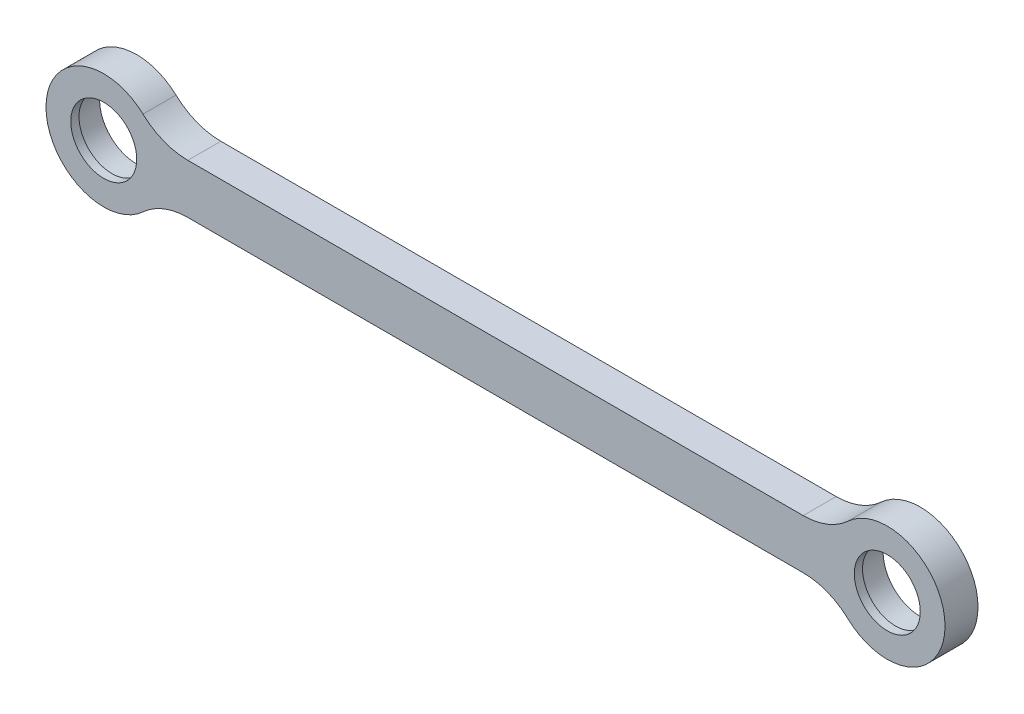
ISO-10303-21;
HEADER;
FILE_DESCRIPTION(('STEP AP214'),'2;1');
FILE_NAME('part.step','',(''),(''),'','','');
FILE_SCHEMA(('AUTOMOTIVE_DESIGN { 1 0 10303 214 1 1 1 1 }'));
ENDSEC;
DATA;
#1=APPLICATION_CONTEXT('core data for automotive mechanical design processes');
#2=APPLICATION_PROTOCOL_DEFINITION('international standard','automotive_design',2000,#1);
#3=PRODUCT_CONTEXT('',#1,'mechanical');
#4=PRODUCT('Part','Part','',(#3));
#5=PRODUCT_RELATED_PRODUCT_CATEGORY('part','',(#4));
#6=PRODUCT_DEFINITION_FORMATION('','',#4);
#7=PRODUCT_DEFINITION_CONTEXT('part definition',#1,'design');
#8=PRODUCT_DEFINITION('design','',#6,#7);
#9=PRODUCT_DEFINITION_SHAPE('','',#8);
#10=(LENGTH_UNIT() NAMED_UNIT(*) SI_UNIT(.MILLI.,.METRE.));
#11=(NAMED_UNIT(*) PLANE_ANGLE_UNIT() SI_UNIT($,.RADIAN.));
#12=(NAMED_UNIT(*) SI_UNIT($,.STERADIAN.) SOLID_ANGLE_UNIT());
#13=UNCERTAINTY_MEASURE_WITH_UNIT(LENGTH_MEASURE(1.E-05),#10,'distance_accuracy_value','');
#14=(GEOMETRIC_REPRESENTATION_CONTEXT(3) GLOBAL_UNCERTAINTY_ASSIGNED_CONTEXT((#13)) GLOBAL_UNIT_ASSIGNED_CONTEXT((#10,
#11,#12)) REPRESENTATION_CONTEXT('',''));
#15=CARTESIAN_POINT('',(0.,0.,0.));
#16=DIRECTION('',(0.,0.,1.));
#17=DIRECTION('',(1.,0.,0.));
#18=AXIS2_PLACEMENT_3D('',#15,#16,#17);
#19=CARTESIAN_POINT('',(0.,0.,0.));
#20=DIRECTION('',(0.,0.,1.));
#21=DIRECTION('',(1.,0.,0.));
#22=AXIS2_PLACEMENT_3D('',#19,#20,#21);
#23=CYLINDRICAL_SURFACE('',#22,4.5);
#24=CARTESIAN_POINT('',(0.,0.,0.));
#25=DIRECTION('',(0.,0.,1.));
#26=DIRECTION('',(1.,0.,0.));
#27=AXIS2_PLACEMENT_3D('',#24,#25,#26);
#28=CIRCLE('',#27,4.5);
#29=CARTESIAN_POINT('',(4.5,0.,0.));
#30=VERTEX_POINT('',#29);
#31=EDGE_CURVE('E224',#30,#30,#28,.T.);
#32=ORIENTED_EDGE('',*,*,#31,.F.);
#33=EDGE_LOOP('',(#32));
#34=FACE_BOUND('',#33,.T.);
#35=CARTESIAN_POINT('',(0.,0.,3.));
#36=DIRECTION('',(0.,0.,1.));
#37=DIRECTION('',(1.,0.,0.));
#38=AXIS2_PLACEMENT_3D('',#35,#36,#37);
#39=CIRCLE('',#38,4.5);
#40=CARTESIAN_POINT('',(4.5,0.,3.));
#41=VERTEX_POINT('',#40);
#42=EDGE_CURVE('E11',#41,#41,#39,.F.);
#43=ORIENTED_EDGE('',*,*,#42,.F.);
#44=EDGE_LOOP('',(#43));
#45=FACE_BOUND('',#44,.T.);
#46=ADVANCED_FACE('F34',(#34,#45),#23,.F.);
#47=CARTESIAN_POINT('',(95.,0.,0.));
#48=DIRECTION('',(0.,0.,1.));
#49=DIRECTION('',(1.,0.,0.));
#50=AXIS2_PLACEMENT_3D('',#47,#48,#49);
#51=CYLINDRICAL_SURFACE('',#50,4.5);
#52=CARTESIAN_POINT('',(95.,0.,0.));
#53=DIRECTION('',(0.,0.,1.));
#54=DIRECTION('',(1.,0.,0.));
#55=AXIS2_PLACEMENT_3D('',#52,#53,#54);
#56=CIRCLE('',#55,4.5);
#57=CARTESIAN_POINT('',(99.5,0.,0.));
#58=VERTEX_POINT('',#57);
#59=EDGE_CURVE('E229',#58,#58,#56,.T.);
#60=ORIENTED_EDGE('',*,*,#59,.F.);
#61=EDGE_LOOP('',(#60));
#62=FACE_BOUND('',#61,.T.);
#63=CARTESIAN_POINT('',(95.,0.,3.));
#64=DIRECTION('',(0.,0.,1.));
#65=DIRECTION('',(1.,0.,0.));
#66=AXIS2_PLACEMENT_3D('',#63,#64,#65);
#67=CIRCLE('',#66,4.5);
#68=CARTESIAN_POINT('',(99.5,0.,3.));
#69=VERTEX_POINT('',#68);
#70=EDGE_CURVE('E42',#69,#69,#67,.F.);
#71=ORIENTED_EDGE('',*,*,#70,.F.);
#72=EDGE_LOOP('',(#71));
#73=FACE_BOUND('',#72,.T.);
#74=ADVANCED_FACE('F163',(#62,#73),#51,.F.);
#75=CARTESIAN_POINT('',(0.,0.,4.));
#76=DIRECTION('',(0.,0.,1.));
#77=DIRECTION('',(1.,0.,0.));
#78=AXIS2_PLACEMENT_3D('',#75,#76,#77);
#79=PLANE('',#78);
#80=DIRECTION('',(-1.,0.,0.));
#81=VECTOR('',#80,1.);
#82=CARTESIAN_POINT('',(6.32455532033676,3.,4.));
#83=LINE('',#82,#81);
#84=CARTESIAN_POINT('',(84.8019609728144,3.,4.));
#85=VERTEX_POINT('',#84);
#86=CARTESIAN_POINT('',(10.1980390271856,3.,4.));
#87=VERTEX_POINT('',#86);
#88=EDGE_CURVE('E119',#85,#87,#83,.T.);
#89=ORIENTED_EDGE('',*,*,#88,.T.);
#90=CARTESIAN_POINT('',(10.1980390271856,11.,4.));
#91=DIRECTION('',(0.,0.,1.));
#92=DIRECTION('',(1.,0.,0.));
#93=AXIS2_PLACEMENT_3D('',#90,#91,#92);
#94=CIRCLE('',#93,8.);
#95=CARTESIAN_POINT('',(4.75908487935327,5.13333333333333,4.));
#96=VERTEX_POINT('',#95);
#97=EDGE_CURVE('E56',#87,#96,#94,.F.);
#98=ORIENTED_EDGE('',*,*,#97,.T.);
#99=CARTESIAN_POINT('',(0.,0.,4.));
#100=DIRECTION('',(0.,0.,1.));
#101=DIRECTION('',(1.,0.,0.));
#102=AXIS2_PLACEMENT_3D('',#99,#100,#101);
#103=CIRCLE('',#102,7.);
#104=CARTESIAN_POINT('',(4.75908487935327,-5.13333333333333,4.));
#105=VERTEX_POINT('',#104);
#106=EDGE_CURVE('E126',#96,#105,#103,.T.);
#107=ORIENTED_EDGE('',*,*,#106,.T.);
#108=CARTESIAN_POINT('',(10.1980390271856,-11.,4.));
#109=DIRECTION('',(0.,0.,1.));
#110=DIRECTION('',(1.,0.,0.));
#111=AXIS2_PLACEMENT_3D('',#108,#109,#110);
#112=CIRCLE('',#111,8.);
#113=CARTESIAN_POINT('',(10.1980390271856,-3.,4.));
#114=VERTEX_POINT('',#113);
#115=EDGE_CURVE('E155',#105,#114,#112,.F.);
#116=ORIENTED_EDGE('',*,*,#115,.T.);
#117=DIRECTION('',(1.,0.,0.));
#118=VECTOR('',#117,1.);
#119=CARTESIAN_POINT('',(6.32455532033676,-3.,4.));
#120=LINE('',#119,#118);
#121=CARTESIAN_POINT('',(84.8019609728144,-3.,4.));
#122=VERTEX_POINT('',#121);
#123=EDGE_CURVE('E129',#114,#122,#120,.T.);
#124=ORIENTED_EDGE('',*,*,#123,.T.);
#125=CARTESIAN_POINT('',(84.8019609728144,-11.,4.));
#126=DIRECTION('',(0.,0.,1.));
#127=DIRECTION('',(1.,0.,0.));
#128=AXIS2_PLACEMENT_3D('',#125,#126,#127);
#129=CIRCLE('',#128,8.);
#130=CARTESIAN_POINT('',(90.2409151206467,-5.13333333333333,4.));
#131=VERTEX_POINT('',#130);
#132=EDGE_CURVE('E151',#122,#131,#129,.F.);
#133=ORIENTED_EDGE('',*,*,#132,.T.);
#134=CARTESIAN_POINT('',(95.,0.,4.));
#135=DIRECTION('',(0.,0.,1.));
#136=DIRECTION('',(1.,0.,0.));
#137=AXIS2_PLACEMENT_3D('',#134,#135,#136);
#138=CIRCLE('',#137,6.99999999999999);
#139=CARTESIAN_POINT('',(90.2409151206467,5.13333333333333,4.));
#140=VERTEX_POINT('',#139);
#141=EDGE_CURVE('E216',#131,#140,#138,.T.);
#142=ORIENTED_EDGE('',*,*,#141,.T.);
#143=CARTESIAN_POINT('',(84.8019609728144,11.,4.));
#144=DIRECTION('',(0.,0.,1.));
#145=DIRECTION('',(1.,0.,0.));
#146=AXIS2_PLACEMENT_3D('',#143,#144,#145);
#147=CIRCLE('',#146,8.);
#148=EDGE_CURVE('E111',#140,#85,#147,.F.);
#149=ORIENTED_EDGE('',*,*,#148,.T.);
#150=EDGE_LOOP('',(#89,#98,#107,#116,#124,#133,#142,#149));
#151=FACE_BOUND('',#150,.T.);
#152=CARTESIAN_POINT('',(95.,0.,4.));
#153=DIRECTION('',(0.,0.,1.));
#154=DIRECTION('',(1.,0.,0.));
#155=AXIS2_PLACEMENT_3D('',#152,#153,#154);
#156=CIRCLE('',#155,4.00000000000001);
#157=CARTESIAN_POINT('',(99.,0.,4.));
#158=VERTEX_POINT('',#157);
#159=EDGE_CURVE('E236',#158,#158,#156,.T.);
#160=ORIENTED_EDGE('',*,*,#159,.F.);
#161=EDGE_LOOP('',(#160));
#162=FACE_BOUND('',#161,.T.);
#163=CARTESIAN_POINT('',(0.,0.,4.));
#164=DIRECTION('',(0.,0.,1.));
#165=DIRECTION('',(1.,0.,0.));
#166=AXIS2_PLACEMENT_3D('',#163,#164,#165);
#167=CIRCLE('',#166,4.);
#168=CARTESIAN_POINT('',(4.,0.,4.));
#169=VERTEX_POINT('',#168);
#170=EDGE_CURVE('E242',#169,#169,#167,.T.);
#171=ORIENTED_EDGE('',*,*,#170,.F.);
#172=EDGE_LOOP('',(#171));
#173=FACE_BOUND('',#172,.T.);
#174=ADVANCED_FACE('F165',(#151,#162,#173),#79,.T.);
#175=CARTESIAN_POINT('',(0.,0.,0.));
#176=DIRECTION('',(0.,0.,1.));
#177=DIRECTION('',(1.,0.,0.));
#178=AXIS2_PLACEMENT_3D('',#175,#176,#177);
#179=PLANE('',#178);
#180=ORIENTED_EDGE('',*,*,#59,.T.);
#181=EDGE_LOOP('',(#180));
#182=FACE_BOUND('',#181,.T.);
#183=ORIENTED_EDGE('',*,*,#31,.T.);
#184=EDGE_LOOP('',(#183));
#185=FACE_BOUND('',#184,.T.);
#186=CARTESIAN_POINT('',(0.,0.,0.));
#187=DIRECTION('',(0.,0.,1.));
#188=DIRECTION('',(1.,0.,0.));
#189=AXIS2_PLACEMENT_3D('',#186,#187,#188);
#190=CIRCLE('',#189,7.);
#191=CARTESIAN_POINT('',(4.75908487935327,5.13333333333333,0.));
#192=VERTEX_POINT('',#191);
#193=CARTESIAN_POINT('',(4.75908487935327,-5.13333333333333,0.));
#194=VERTEX_POINT('',#193);
#195=EDGE_CURVE('E223',#192,#194,#190,.T.);
#196=ORIENTED_EDGE('',*,*,#195,.F.);
#197=CARTESIAN_POINT('',(10.1980390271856,11.,0.));
#198=DIRECTION('',(0.,0.,1.));
#199=DIRECTION('',(1.,0.,0.));
#200=AXIS2_PLACEMENT_3D('',#197,#198,#199);
#201=CIRCLE('',#200,8.);
#202=CARTESIAN_POINT('',(10.1980390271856,3.,0.));
#203=VERTEX_POINT('',#202);
#204=EDGE_CURVE('E125',#192,#203,#201,.T.);
#205=ORIENTED_EDGE('',*,*,#204,.T.);
#206=DIRECTION('',(-1.,0.,0.));
#207=VECTOR('',#206,1.);
#208=CARTESIAN_POINT('',(6.32455532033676,3.,0.));
#209=LINE('',#208,#207);
#210=CARTESIAN_POINT('',(84.8019609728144,3.,0.));
#211=VERTEX_POINT('',#210);
#212=EDGE_CURVE('E117',#211,#203,#209,.T.);
#213=ORIENTED_EDGE('',*,*,#212,.F.);
#214=CARTESIAN_POINT('',(84.8019609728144,11.,0.));
#215=DIRECTION('',(0.,0.,1.));
#216=DIRECTION('',(1.,0.,0.));
#217=AXIS2_PLACEMENT_3D('',#214,#215,#216);
#218=CIRCLE('',#217,8.);
#219=CARTESIAN_POINT('',(90.2409151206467,5.13333333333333,0.));
#220=VERTEX_POINT('',#219);
#221=EDGE_CURVE('E101',#211,#220,#218,.T.);
#222=ORIENTED_EDGE('',*,*,#221,.T.);
#223=CARTESIAN_POINT('',(95.,0.,0.));
#224=DIRECTION('',(0.,0.,1.));
#225=DIRECTION('',(1.,0.,0.));
#226=AXIS2_PLACEMENT_3D('',#223,#224,#225);
#227=CIRCLE('',#226,6.99999999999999);
#228=CARTESIAN_POINT('',(90.2409151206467,-5.13333333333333,0.));
#229=VERTEX_POINT('',#228);
#230=EDGE_CURVE('E127',#229,#220,#227,.T.);
#231=ORIENTED_EDGE('',*,*,#230,.F.);
#232=CARTESIAN_POINT('',(84.8019609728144,-11.,0.));
#233=DIRECTION('',(0.,0.,1.));
#234=DIRECTION('',(1.,0.,0.));
#235=AXIS2_PLACEMENT_3D('',#232,#233,#234);
#236=CIRCLE('',#235,8.);
#237=CARTESIAN_POINT('',(84.8019609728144,-3.,0.));
#238=VERTEX_POINT('',#237);
#239=EDGE_CURVE('E149',#229,#238,#236,.T.);
#240=ORIENTED_EDGE('',*,*,#239,.T.);
#241=DIRECTION('',(1.,0.,0.));
#242=VECTOR('',#241,1.);
#243=CARTESIAN_POINT('',(6.32455532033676,-3.,0.));
#244=LINE('',#243,#242);
#245=CARTESIAN_POINT('',(10.1980390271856,-3.,0.));
#246=VERTEX_POINT('',#245);
#247=EDGE_CURVE('E131',#246,#238,#244,.T.);
#248=ORIENTED_EDGE('',*,*,#247,.F.);
#249=CARTESIAN_POINT('',(10.1980390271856,-11.,0.));
#250=DIRECTION('',(0.,0.,1.));
#251=DIRECTION('',(1.,0.,0.));
#252=AXIS2_PLACEMENT_3D('',#249,#250,#251);
#253=CIRCLE('',#252,8.);
#254=EDGE_CURVE('E153',#246,#194,#253,.T.);
#255=ORIENTED_EDGE('',*,*,#254,.T.);
#256=EDGE_LOOP('',(#196,#205,#213,#222,#231,#240,#248,#255));
#257=FACE_BOUND('',#256,.T.);
#258=ADVANCED_FACE('F124',(#182,#185,#257),#179,.F.);
#259=CARTESIAN_POINT('',(0.,0.,4.));
#260=DIRECTION('',(0.,0.,-1.));
#261=DIRECTION('',(-1.,0.,0.));
#262=AXIS2_PLACEMENT_3D('',#259,#260,#261);
#263=CYLINDRICAL_SURFACE('',#262,7.);
#264=ORIENTED_EDGE('',*,*,#195,.T.);
#265=DIRECTION('',(0.,0.,-1.));
#266=VECTOR('',#265,1.);
#267=CARTESIAN_POINT('',(4.75908487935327,-5.13333333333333,4.));
#268=LINE('',#267,#266);
#269=EDGE_CURVE('E49',#194,#105,#268,.F.);
#270=ORIENTED_EDGE('',*,*,#269,.T.);
#271=ORIENTED_EDGE('',*,*,#106,.F.);
#272=DIRECTION('',(0.,0.,-1.));
#273=VECTOR('',#272,1.);
#274=CARTESIAN_POINT('',(4.75908487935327,5.13333333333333,4.));
#275=LINE('',#274,#273);
#276=EDGE_CURVE('E144',#96,#192,#275,.T.);
#277=ORIENTED_EDGE('',*,*,#276,.T.);
#278=EDGE_LOOP('',(#264,#270,#271,#277));
#279=FACE_BOUND('',#278,.T.);
#280=ADVANCED_FACE('F181',(#279),#263,.T.);
#281=CARTESIAN_POINT('',(6.32455532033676,-3.,4.));
#282=DIRECTION('',(0.,1.,0.));
#283=DIRECTION('',(0.,0.,1.));
#284=AXIS2_PLACEMENT_3D('',#281,#282,#283);
#285=PLANE('',#284);
#286=ORIENTED_EDGE('',*,*,#247,.T.);
#287=DIRECTION('',(0.,0.,1.));
#288=VECTOR('',#287,1.);
#289=CARTESIAN_POINT('',(84.8019609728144,-3.,4.));
#290=LINE('',#289,#288);
#291=EDGE_CURVE('E142',#238,#122,#290,.T.);
#292=ORIENTED_EDGE('',*,*,#291,.T.);
#293=ORIENTED_EDGE('',*,*,#123,.F.);
#294=DIRECTION('',(0.,0.,1.));
#295=VECTOR('',#294,1.);
#296=CARTESIAN_POINT('',(10.1980390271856,-3.,0.));
#297=LINE('',#296,#295);
#298=EDGE_CURVE('E139',#114,#246,#297,.F.);
#299=ORIENTED_EDGE('',*,*,#298,.T.);
#300=EDGE_LOOP('',(#286,#292,#293,#299));
#301=FACE_BOUND('',#300,.T.);
#302=ADVANCED_FACE('F188',(#301),#285,.F.);
#303=CARTESIAN_POINT('',(95.,0.,4.));
#304=DIRECTION('',(0.,0.,-1.));
#305=DIRECTION('',(-1.,0.,0.));
#306=AXIS2_PLACEMENT_3D('',#303,#304,#305);
#307=CYLINDRICAL_SURFACE('',#306,6.99999999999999);
#308=ORIENTED_EDGE('',*,*,#230,.T.);
#309=DIRECTION('',(0.,0.,-1.));
#310=VECTOR('',#309,1.);
#311=CARTESIAN_POINT('',(90.2409151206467,5.13333333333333,4.));
#312=LINE('',#311,#310);
#313=EDGE_CURVE('E106',#220,#140,#312,.F.);
#314=ORIENTED_EDGE('',*,*,#313,.T.);
#315=ORIENTED_EDGE('',*,*,#141,.F.);
#316=DIRECTION('',(0.,0.,-1.));
#317=VECTOR('',#316,1.);
#318=CARTESIAN_POINT('',(90.2409151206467,-5.13333333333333,4.));
#319=LINE('',#318,#317);
#320=EDGE_CURVE('E120',#131,#229,#319,.T.);
#321=ORIENTED_EDGE('',*,*,#320,.T.);
#322=EDGE_LOOP('',(#308,#314,#315,#321));
#323=FACE_BOUND('',#322,.T.);
#324=ADVANCED_FACE('F185',(#323),#307,.T.);
#325=CARTESIAN_POINT('',(6.32455532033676,3.,4.));
#326=DIRECTION('',(0.,-1.,0.));
#327=DIRECTION('',(0.,0.,-1.));
#328=AXIS2_PLACEMENT_3D('',#325,#326,#327);
#329=PLANE('',#328);
#330=ORIENTED_EDGE('',*,*,#88,.F.);
#331=DIRECTION('',(0.,0.,1.));
#332=VECTOR('',#331,1.);
#333=CARTESIAN_POINT('',(84.8019609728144,3.,0.));
#334=LINE('',#333,#332);
#335=EDGE_CURVE('E105',#85,#211,#334,.F.);
#336=ORIENTED_EDGE('',*,*,#335,.T.);
#337=ORIENTED_EDGE('',*,*,#212,.T.);
#338=DIRECTION('',(0.,0.,1.));
#339=VECTOR('',#338,1.);
#340=CARTESIAN_POINT('',(10.1980390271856,3.,4.));
#341=LINE('',#340,#339);
#342=EDGE_CURVE('E121',#203,#87,#341,.T.);
#343=ORIENTED_EDGE('',*,*,#342,.T.);
#344=EDGE_LOOP('',(#330,#336,#337,#343));
#345=FACE_BOUND('',#344,.T.);
#346=ADVANCED_FACE('F116',(#345),#329,.F.);
#347=CARTESIAN_POINT('',(84.8019609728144,11.,4.));
#348=DIRECTION('',(0.,0.,-1.));
#349=DIRECTION('',(-1.,0.,0.));
#350=AXIS2_PLACEMENT_3D('',#347,#348,#349);
#351=CYLINDRICAL_SURFACE('',#350,8.);
#352=ORIENTED_EDGE('',*,*,#148,.F.);
#353=ORIENTED_EDGE('',*,*,#313,.F.);
#354=ORIENTED_EDGE('',*,*,#221,.F.);
#355=ORIENTED_EDGE('',*,*,#335,.F.);
#356=EDGE_LOOP('',(#352,#353,#354,#355));
#357=FACE_BOUND('',#356,.T.);
#358=ADVANCED_FACE('F104',(#357),#351,.F.);
#359=CARTESIAN_POINT('',(84.8019609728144,-11.,4.));
#360=DIRECTION('',(0.,0.,-1.));
#361=DIRECTION('',(-1.,0.,0.));
#362=AXIS2_PLACEMENT_3D('',#359,#360,#361);
#363=CYLINDRICAL_SURFACE('',#362,8.);
#364=ORIENTED_EDGE('',*,*,#132,.F.);
#365=ORIENTED_EDGE('',*,*,#291,.F.);
#366=ORIENTED_EDGE('',*,*,#239,.F.);
#367=ORIENTED_EDGE('',*,*,#320,.F.);
#368=EDGE_LOOP('',(#364,#365,#366,#367));
#369=FACE_BOUND('',#368,.T.);
#370=ADVANCED_FACE('F197',(#369),#363,.F.);
#371=CARTESIAN_POINT('',(10.1980390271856,-11.,4.));
#372=DIRECTION('',(0.,0.,-1.));
#373=DIRECTION('',(-1.,0.,0.));
#374=AXIS2_PLACEMENT_3D('',#371,#372,#373);
#375=CYLINDRICAL_SURFACE('',#374,8.);
#376=ORIENTED_EDGE('',*,*,#115,.F.);
#377=ORIENTED_EDGE('',*,*,#269,.F.);
#378=ORIENTED_EDGE('',*,*,#254,.F.);
#379=ORIENTED_EDGE('',*,*,#298,.F.);
#380=EDGE_LOOP('',(#376,#377,#378,#379));
#381=FACE_BOUND('',#380,.T.);
#382=ADVANCED_FACE('F199',(#381),#375,.F.);
#383=CARTESIAN_POINT('',(10.1980390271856,11.,4.));
#384=DIRECTION('',(0.,0.,-1.));
#385=DIRECTION('',(-1.,0.,0.));
#386=AXIS2_PLACEMENT_3D('',#383,#384,#385);
#387=CYLINDRICAL_SURFACE('',#386,8.);
#388=ORIENTED_EDGE('',*,*,#97,.F.);
#389=ORIENTED_EDGE('',*,*,#342,.F.);
#390=ORIENTED_EDGE('',*,*,#204,.F.);
#391=ORIENTED_EDGE('',*,*,#276,.F.);
#392=EDGE_LOOP('',(#388,#389,#390,#391));
#393=FACE_BOUND('',#392,.T.);
#394=ADVANCED_FACE('F36',(#393),#387,.F.);
#395=CARTESIAN_POINT('',(95.,0.,3.));
#396=DIRECTION('',(0.,0.,1.));
#397=DIRECTION('',(1.,0.,0.));
#398=AXIS2_PLACEMENT_3D('',#395,#396,#397);
#399=PLANE('',#398);
#400=CARTESIAN_POINT('',(95.,0.,3.));
#401=DIRECTION('',(0.,0.,1.));
#402=DIRECTION('',(1.,0.,0.));
#403=AXIS2_PLACEMENT_3D('',#400,#401,#402);
#404=CIRCLE('',#403,4.00000000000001);
#405=CARTESIAN_POINT('',(99.,0.,3.));
#406=VERTEX_POINT('',#405);
#407=EDGE_CURVE('E233',#406,#406,#404,.T.);
#408=ORIENTED_EDGE('',*,*,#407,.T.);
#409=EDGE_LOOP('',(#408));
#410=FACE_BOUND('',#409,.T.);
#411=ORIENTED_EDGE('',*,*,#70,.T.);
#412=EDGE_LOOP('',(#411));
#413=FACE_BOUND('',#412,.T.);
#414=ADVANCED_FACE('F161',(#410,#413),#399,.F.);
#415=CARTESIAN_POINT('',(95.,0.,3.));
#416=DIRECTION('',(0.,0.,1.));
#417=DIRECTION('',(1.,0.,0.));
#418=AXIS2_PLACEMENT_3D('',#415,#416,#417);
#419=CYLINDRICAL_SURFACE('',#418,4.00000000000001);
#420=ORIENTED_EDGE('',*,*,#407,.F.);
#421=EDGE_LOOP('',(#420));
#422=FACE_BOUND('',#421,.T.);
#423=ORIENTED_EDGE('',*,*,#159,.T.);
#424=EDGE_LOOP('',(#423));
#425=FACE_BOUND('',#424,.T.);
#426=ADVANCED_FACE('F260',(#422,#425),#419,.F.);
#427=CARTESIAN_POINT('',(0.,0.,3.));
#428=DIRECTION('',(0.,0.,1.));
#429=DIRECTION('',(1.,0.,0.));
#430=AXIS2_PLACEMENT_3D('',#427,#428,#429);
#431=PLANE('',#430);
#432=CARTESIAN_POINT('',(0.,0.,3.));
#433=DIRECTION('',(0.,0.,1.));
#434=DIRECTION('',(1.,0.,0.));
#435=AXIS2_PLACEMENT_3D('',#432,#433,#434);
#436=CIRCLE('',#435,4.);
#437=CARTESIAN_POINT('',(4.,0.,3.));
#438=VERTEX_POINT('',#437);
#439=EDGE_CURVE('E239',#438,#438,#436,.T.);
#440=ORIENTED_EDGE('',*,*,#439,.T.);
#441=EDGE_LOOP('',(#440));
#442=FACE_BOUND('',#441,.T.);
#443=ORIENTED_EDGE('',*,*,#42,.T.);
#444=EDGE_LOOP('',(#443));
#445=FACE_BOUND('',#444,.T.);
#446=ADVANCED_FACE('F248',(#442,#445),#431,.F.);
#447=CARTESIAN_POINT('',(0.,0.,3.));
#448=DIRECTION('',(0.,0.,1.));
#449=DIRECTION('',(1.,0.,0.));
#450=AXIS2_PLACEMENT_3D('',#447,#448,#449);
#451=CYLINDRICAL_SURFACE('',#450,4.);
#452=ORIENTED_EDGE('',*,*,#439,.F.);
#453=EDGE_LOOP('',(#452));
#454=FACE_BOUND('',#453,.T.);
#455=ORIENTED_EDGE('',*,*,#170,.T.);
#456=EDGE_LOOP('',(#455));
#457=FACE_BOUND('',#456,.T.);
#458=ADVANCED_FACE('F251',(#454,#457),#451,.F.);
#459=CLOSED_SHELL('',(#46,#74,#174,#258,#280,#302,#324,#346,#358,#370,#382,#394,#414,#426,#446,#458));
#460=MANIFOLD_SOLID_BREP('B2',#459);
#461=ADVANCED_BREP_SHAPE_REPRESENTATION('',(#18,#460),#14);
#462=SHAPE_DEFINITION_REPRESENTATION(#9,#461);
ENDSEC;
END-ISO-10303-21;
